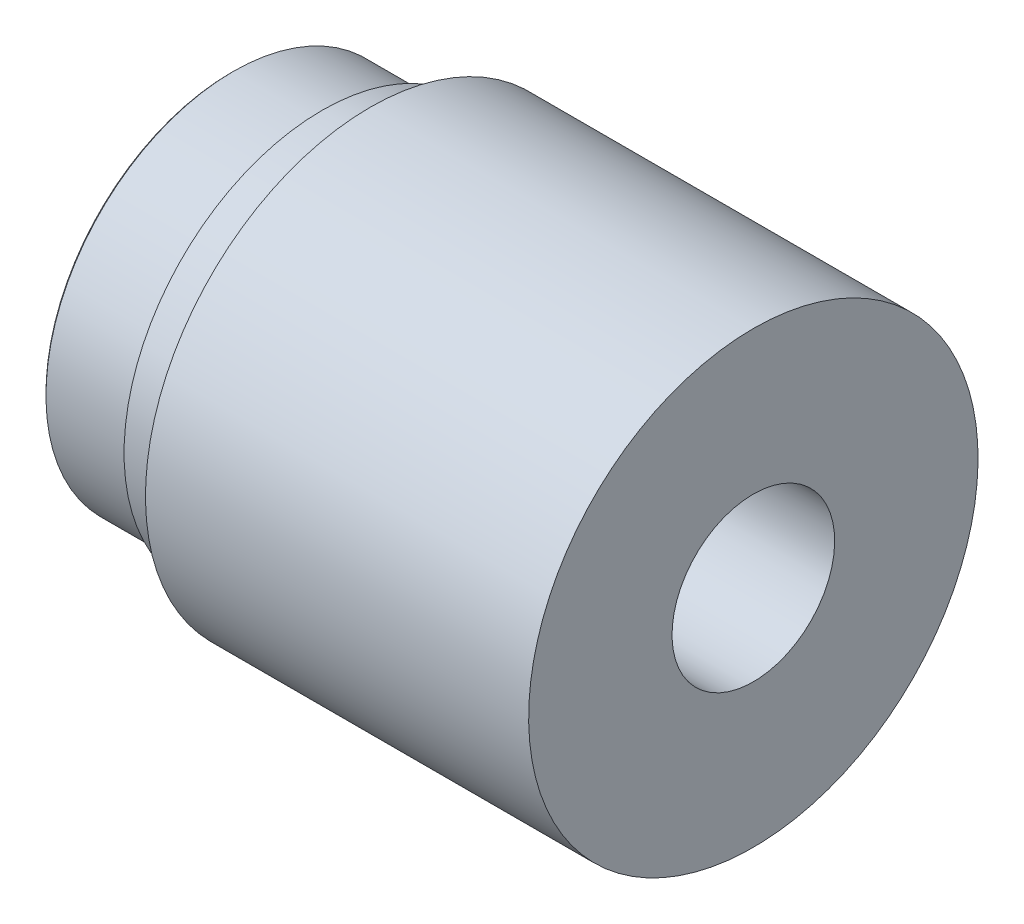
ISO-10303-21;
HEADER;
FILE_DESCRIPTION(('STEP AP214'),'2;1');
FILE_NAME('part.step','',(''),(''),'','','');
FILE_SCHEMA(('AUTOMOTIVE_DESIGN { 1 0 10303 214 1 1 1 1 }'));
ENDSEC;
DATA;
#1=APPLICATION_CONTEXT('core data for automotive mechanical design processes');
#2=APPLICATION_PROTOCOL_DEFINITION('international standard','automotive_design',2000,#1);
#3=PRODUCT_CONTEXT('',#1,'mechanical');
#4=PRODUCT('Part','Part','',(#3));
#5=PRODUCT_RELATED_PRODUCT_CATEGORY('part','',(#4));
#6=PRODUCT_DEFINITION_FORMATION('','',#4);
#7=PRODUCT_DEFINITION_CONTEXT('part definition',#1,'design');
#8=PRODUCT_DEFINITION('design','',#6,#7);
#9=PRODUCT_DEFINITION_SHAPE('','',#8);
#10=(LENGTH_UNIT() NAMED_UNIT(*) SI_UNIT(.MILLI.,.METRE.));
#11=(NAMED_UNIT(*) PLANE_ANGLE_UNIT() SI_UNIT($,.RADIAN.));
#12=(NAMED_UNIT(*) SI_UNIT($,.STERADIAN.) SOLID_ANGLE_UNIT());
#13=UNCERTAINTY_MEASURE_WITH_UNIT(LENGTH_MEASURE(1.E-05),#10,'distance_accuracy_value','');
#14=(GEOMETRIC_REPRESENTATION_CONTEXT(3) GLOBAL_UNCERTAINTY_ASSIGNED_CONTEXT((#13)) GLOBAL_UNIT_ASSIGNED_CONTEXT((#10,
#11,#12)) REPRESENTATION_CONTEXT('',''));
#15=CARTESIAN_POINT('',(0.,0.,0.));
#16=DIRECTION('',(0.,0.,1.));
#17=DIRECTION('',(1.,0.,0.));
#18=AXIS2_PLACEMENT_3D('',#15,#16,#17);
#19=CARTESIAN_POINT('',(-9.34941102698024,110.123212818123,0.));
#20=DIRECTION('',(1.,0.,0.));
#21=DIRECTION('',(0.,1.,0.));
#22=AXIS2_PLACEMENT_3D('',#19,#20,#21);
#23=PLANE('',#22);
#24=CARTESIAN_POINT('',(-9.34941102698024,89.1232105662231,0.));
#25=DIRECTION('',(1.,0.,0.));
#26=DIRECTION('',(0.,1.,0.));
#27=AXIS2_PLACEMENT_3D('',#24,#25,#26);
#28=CIRCLE('',#27,7.6);
#29=CARTESIAN_POINT('',(-9.34941102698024,96.7232105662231,0.));
#30=VERTEX_POINT('',#29);
#31=EDGE_CURVE('E57',#30,#30,#28,.T.);
#32=ORIENTED_EDGE('',*,*,#31,.F.);
#33=EDGE_LOOP('',(#32));
#34=FACE_BOUND('',#33,.T.);
#35=CARTESIAN_POINT('',(-9.34941102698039,89.1232105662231,0.));
#36=DIRECTION('',(1.,0.,0.));
#37=DIRECTION('',(0.,1.,0.));
#38=AXIS2_PLACEMENT_3D('',#35,#36,#37);
#39=CIRCLE('',#38,21.0000022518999);
#40=CARTESIAN_POINT('',(-9.34941102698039,110.123212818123,0.));
#41=VERTEX_POINT('',#40);
#42=EDGE_CURVE('E10',#41,#41,#39,.T.);
#43=ORIENTED_EDGE('',*,*,#42,.T.);
#44=EDGE_LOOP('',(#43));
#45=FACE_BOUND('',#44,.T.);
#46=ADVANCED_FACE('F28',(#34,#45),#23,.T.);
#47=CARTESIAN_POINT('',(-9.34941102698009,89.1232105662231,0.));
#48=DIRECTION('',(1.,0.,0.));
#49=DIRECTION('',(0.,1.,0.));
#50=AXIS2_PLACEMENT_3D('',#47,#48,#49);
#51=CYLINDRICAL_SURFACE('',#50,21.0000022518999);
#52=CARTESIAN_POINT('',(-45.159997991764,89.1232105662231,0.));
#53=DIRECTION('',(1.,0.,0.));
#54=DIRECTION('',(0.,1.,0.));
#55=AXIS2_PLACEMENT_3D('',#52,#53,#54);
#56=CIRCLE('',#55,21.0000022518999);
#57=CARTESIAN_POINT('',(-45.159997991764,110.123212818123,0.));
#58=VERTEX_POINT('',#57);
#59=EDGE_CURVE('E34',#58,#58,#56,.T.);
#60=ORIENTED_EDGE('',*,*,#59,.T.);
#61=EDGE_LOOP('',(#60));
#62=FACE_BOUND('',#61,.T.);
#63=ORIENTED_EDGE('',*,*,#42,.F.);
#64=EDGE_LOOP('',(#63));
#65=FACE_BOUND('',#64,.T.);
#66=ADVANCED_FACE('F73',(#62,#65),#51,.T.);
#67=CARTESIAN_POINT('',(-45.1599977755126,107.623212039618,0.));
#68=DIRECTION('',(-1.,0.,0.));
#69=DIRECTION('',(0.,-1.,0.));
#70=AXIS2_PLACEMENT_3D('',#67,#68,#69);
#71=PLANE('',#70);
#72=CARTESIAN_POINT('',(-45.1599975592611,89.1232105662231,0.));
#73=DIRECTION('',(1.,0.,0.));
#74=DIRECTION('',(0.,1.,0.));
#75=AXIS2_PLACEMENT_3D('',#72,#73,#74);
#76=CIRCLE('',#75,18.5000014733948);
#77=CARTESIAN_POINT('',(-45.1599975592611,107.623212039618,0.));
#78=VERTEX_POINT('',#77);
#79=EDGE_CURVE('E38',#78,#78,#76,.T.);
#80=ORIENTED_EDGE('',*,*,#79,.T.);
#81=EDGE_LOOP('',(#80));
#82=FACE_BOUND('',#81,.T.);
#83=ORIENTED_EDGE('',*,*,#59,.F.);
#84=EDGE_LOOP('',(#83));
#85=FACE_BOUND('',#84,.T.);
#86=ADVANCED_FACE('F77',(#82,#85),#71,.T.);
#87=CARTESIAN_POINT('',(-9.34941102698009,89.1232105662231,0.));
#88=DIRECTION('',(1.,0.,0.));
#89=DIRECTION('',(0.,1.,0.));
#90=AXIS2_PLACEMENT_3D('',#87,#88,#89);
#91=CYLINDRICAL_SURFACE('',#90,18.5000014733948);
#92=CARTESIAN_POINT('',(-49.6599975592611,89.1232105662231,0.));
#93=DIRECTION('',(1.,0.,0.));
#94=DIRECTION('',(0.,1.,0.));
#95=AXIS2_PLACEMENT_3D('',#92,#93,#94);
#96=CIRCLE('',#95,18.5000014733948);
#97=CARTESIAN_POINT('',(-49.6599975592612,107.623212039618,0.));
#98=VERTEX_POINT('',#97);
#99=EDGE_CURVE('E42',#98,#98,#96,.T.);
#100=ORIENTED_EDGE('',*,*,#99,.T.);
#101=EDGE_LOOP('',(#100));
#102=FACE_BOUND('',#101,.T.);
#103=ORIENTED_EDGE('',*,*,#79,.F.);
#104=EDGE_LOOP('',(#103));
#105=FACE_BOUND('',#104,.T.);
#106=ADVANCED_FACE('F81',(#102,#105),#91,.T.);
#107=CARTESIAN_POINT('',(-49.6599974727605,106.623210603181,0.));
#108=DIRECTION('',(-1.,0.,0.));
#109=DIRECTION('',(0.,-1.,0.));
#110=AXIS2_PLACEMENT_3D('',#107,#108,#109);
#111=PLANE('',#110);
#112=CARTESIAN_POINT('',(-49.6599973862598,89.1232105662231,0.));
#113=DIRECTION('',(1.,0.,0.));
#114=DIRECTION('',(0.,1.,0.));
#115=AXIS2_PLACEMENT_3D('',#112,#113,#114);
#116=CIRCLE('',#115,17.5000000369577);
#117=CARTESIAN_POINT('',(-49.6599973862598,106.623210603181,0.));
#118=VERTEX_POINT('',#117);
#119=EDGE_CURVE('E47',#118,#118,#116,.T.);
#120=ORIENTED_EDGE('',*,*,#119,.T.);
#121=EDGE_LOOP('',(#120));
#122=FACE_BOUND('',#121,.T.);
#123=ORIENTED_EDGE('',*,*,#99,.F.);
#124=EDGE_LOOP('',(#123));
#125=FACE_BOUND('',#124,.T.);
#126=ADVANCED_FACE('F88',(#122,#125),#111,.T.);
#127=CARTESIAN_POINT('',(-9.34941102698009,89.1232105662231,0.));
#128=DIRECTION('',(1.,0.,0.));
#129=DIRECTION('',(0.,1.,0.));
#130=AXIS2_PLACEMENT_3D('',#127,#128,#129);
#131=CYLINDRICAL_SURFACE('',#130,17.5000000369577);
#132=CARTESIAN_POINT('',(-57.9599973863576,89.1232105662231,0.));
#133=DIRECTION('',(1.,0.,0.));
#134=DIRECTION('',(0.,1.,0.));
#135=AXIS2_PLACEMENT_3D('',#132,#133,#134);
#136=CIRCLE('',#135,17.5000000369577);
#137=CARTESIAN_POINT('',(-57.9599973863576,106.623210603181,0.));
#138=VERTEX_POINT('',#137);
#139=EDGE_CURVE('E50',#138,#138,#136,.T.);
#140=ORIENTED_EDGE('',*,*,#139,.T.);
#141=EDGE_LOOP('',(#140));
#142=FACE_BOUND('',#141,.T.);
#143=ORIENTED_EDGE('',*,*,#119,.F.);
#144=EDGE_LOOP('',(#143));
#145=FACE_BOUND('',#144,.T.);
#146=ADVANCED_FACE('F92',(#142,#145),#131,.T.);
#147=CARTESIAN_POINT('',(-57.9599973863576,89.1232105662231,0.));
#148=DIRECTION('',(1.,0.,0.));
#149=DIRECTION('',(0.,1.,0.));
#150=AXIS2_PLACEMENT_3D('',#147,#148,#149);
#151=CONICAL_SURFACE('',#150,17.5000000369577,0.785398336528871);
#152=CARTESIAN_POINT('',(-58.1599973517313,89.1232105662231,0.));
#153=DIRECTION('',(1.,0.,0.));
#154=DIRECTION('',(0.,1.,0.));
#155=AXIS2_PLACEMENT_3D('',#152,#153,#154);
#156=CIRCLE('',#155,17.3000000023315);
#157=CARTESIAN_POINT('',(-58.1599973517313,106.423210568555,0.));
#158=VERTEX_POINT('',#157);
#159=EDGE_CURVE('E53',#158,#158,#156,.T.);
#160=ORIENTED_EDGE('',*,*,#159,.T.);
#161=EDGE_LOOP('',(#160));
#162=FACE_BOUND('',#161,.T.);
#163=ORIENTED_EDGE('',*,*,#139,.F.);
#164=EDGE_LOOP('',(#163));
#165=FACE_BOUND('',#164,.T.);
#166=ADVANCED_FACE('F96',(#162,#165),#151,.T.);
#167=CARTESIAN_POINT('',(-58.1599958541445,89.1232105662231,0.));
#168=DIRECTION('',(-1.,0.,0.));
#169=DIRECTION('',(0.,-1.,0.));
#170=AXIS2_PLACEMENT_3D('',#167,#168,#169);
#171=PLANE('',#170);
#172=CARTESIAN_POINT('',(-58.1599973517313,89.1232105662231,0.));
#173=DIRECTION('',(1.,0.,0.));
#174=DIRECTION('',(0.,1.,0.));
#175=AXIS2_PLACEMENT_3D('',#172,#173,#174);
#176=CIRCLE('',#175,7.6);
#177=CARTESIAN_POINT('',(-58.1599973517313,96.7232105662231,0.));
#178=VERTEX_POINT('',#177);
#179=EDGE_CURVE('E56',#178,#178,#176,.T.);
#180=ORIENTED_EDGE('',*,*,#179,.T.);
#181=EDGE_LOOP('',(#180));
#182=FACE_BOUND('',#181,.T.);
#183=ORIENTED_EDGE('',*,*,#159,.F.);
#184=EDGE_LOOP('',(#183));
#185=FACE_BOUND('',#184,.T.);
#186=ADVANCED_FACE('F63',(#182,#185),#171,.T.);
#187=CARTESIAN_POINT('',(-58.1599973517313,89.1232105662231,0.));
#188=DIRECTION('',(1.,0.,0.));
#189=DIRECTION('',(0.,1.,0.));
#190=AXIS2_PLACEMENT_3D('',#187,#188,#189);
#191=CYLINDRICAL_SURFACE('',#190,7.6);
#192=ORIENTED_EDGE('',*,*,#179,.F.);
#193=EDGE_LOOP('',(#192));
#194=FACE_BOUND('',#193,.T.);
#195=ORIENTED_EDGE('',*,*,#31,.T.);
#196=EDGE_LOOP('',(#195));
#197=FACE_BOUND('',#196,.T.);
#198=ADVANCED_FACE('F66',(#194,#197),#191,.F.);
#199=CLOSED_SHELL('',(#46,#66,#86,#106,#126,#146,#166,#186,#198));
#200=MANIFOLD_SOLID_BREP('B2',#199);
#201=ADVANCED_BREP_SHAPE_REPRESENTATION('',(#18,#200),#14);
#202=SHAPE_DEFINITION_REPRESENTATION(#9,#201);
ENDSEC;
END-ISO-10303-21;
